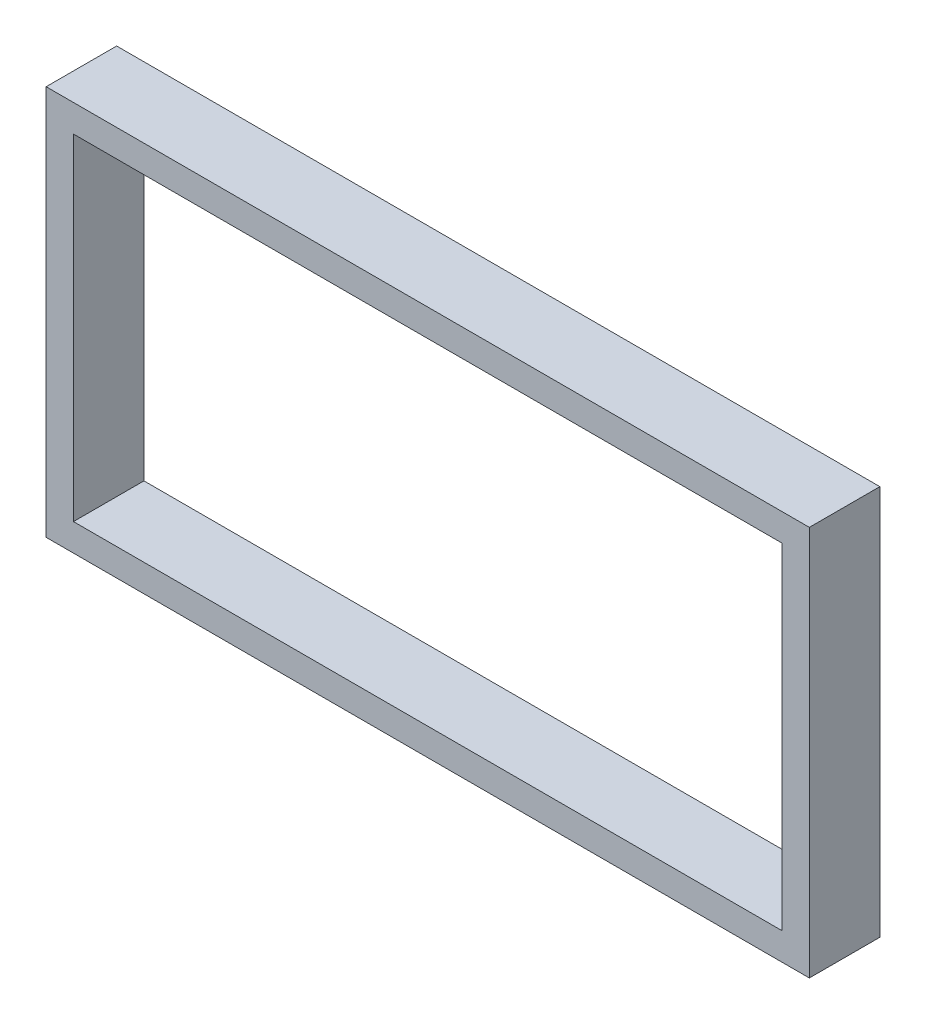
ISO-10303-21;
HEADER;
FILE_DESCRIPTION(('STEP AP214'),'2;1');
FILE_NAME('part.step','',(''),(''),'','','');
FILE_SCHEMA(('AUTOMOTIVE_DESIGN { 1 0 10303 214 1 1 1 1 }'));
ENDSEC;
DATA;
#1=APPLICATION_CONTEXT('core data for automotive mechanical design processes');
#2=APPLICATION_PROTOCOL_DEFINITION('international standard','automotive_design',2000,#1);
#3=PRODUCT_CONTEXT('',#1,'mechanical');
#4=PRODUCT('Part','Part','',(#3));
#5=PRODUCT_RELATED_PRODUCT_CATEGORY('part','',(#4));
#6=PRODUCT_DEFINITION_FORMATION('','',#4);
#7=PRODUCT_DEFINITION_CONTEXT('part definition',#1,'design');
#8=PRODUCT_DEFINITION('design','',#6,#7);
#9=PRODUCT_DEFINITION_SHAPE('','',#8);
#10=(LENGTH_UNIT() NAMED_UNIT(*) SI_UNIT(.MILLI.,.METRE.));
#11=(NAMED_UNIT(*) PLANE_ANGLE_UNIT() SI_UNIT($,.RADIAN.));
#12=(NAMED_UNIT(*) SI_UNIT($,.STERADIAN.) SOLID_ANGLE_UNIT());
#13=UNCERTAINTY_MEASURE_WITH_UNIT(LENGTH_MEASURE(1.E-05),#10,'distance_accuracy_value','');
#14=(GEOMETRIC_REPRESENTATION_CONTEXT(3) GLOBAL_UNCERTAINTY_ASSIGNED_CONTEXT((#13)) GLOBAL_UNIT_ASSIGNED_CONTEXT((#10,
#11,#12)) REPRESENTATION_CONTEXT('',''));
#15=CARTESIAN_POINT('',(0.,0.,0.));
#16=DIRECTION('',(0.,0.,1.));
#17=DIRECTION('',(1.,0.,0.));
#18=AXIS2_PLACEMENT_3D('',#15,#16,#17);
#19=CARTESIAN_POINT('',(55.88,28.575,10.3251));
#20=DIRECTION('',(-1.,0.,0.));
#21=DIRECTION('',(0.,-1.,0.));
#22=AXIS2_PLACEMENT_3D('',#19,#20,#21);
#23=PLANE('',#22);
#24=DIRECTION('',(0.,1.,0.));
#25=VECTOR('',#24,1.);
#26=CARTESIAN_POINT('',(55.88,28.575,0.));
#27=LINE('',#26,#25);
#28=CARTESIAN_POINT('',(55.88,-28.575,0.));
#29=VERTEX_POINT('',#28);
#30=CARTESIAN_POINT('',(55.88,28.575,0.));
#31=VERTEX_POINT('',#30);
#32=EDGE_CURVE('E130',#29,#31,#27,.T.);
#33=ORIENTED_EDGE('',*,*,#32,.T.);
#34=DIRECTION('',(0.,0.,-1.));
#35=VECTOR('',#34,1.);
#36=CARTESIAN_POINT('',(55.88,28.575,10.3251));
#37=LINE('',#36,#35);
#38=CARTESIAN_POINT('',(55.88,28.575,10.3251));
#39=VERTEX_POINT('',#38);
#40=EDGE_CURVE('E11',#39,#31,#37,.T.);
#41=ORIENTED_EDGE('',*,*,#40,.F.);
#42=DIRECTION('',(0.,1.,0.));
#43=VECTOR('',#42,1.);
#44=CARTESIAN_POINT('',(55.88,28.575,10.3251));
#45=LINE('',#44,#43);
#46=CARTESIAN_POINT('',(55.88,-28.575,10.3251));
#47=VERTEX_POINT('',#46);
#48=EDGE_CURVE('E134',#47,#39,#45,.T.);
#49=ORIENTED_EDGE('',*,*,#48,.F.);
#50=DIRECTION('',(0.,0.,-1.));
#51=VECTOR('',#50,1.);
#52=CARTESIAN_POINT('',(55.88,-28.575,10.3251));
#53=LINE('',#52,#51);
#54=EDGE_CURVE('E144',#47,#29,#53,.T.);
#55=ORIENTED_EDGE('',*,*,#54,.T.);
#56=EDGE_LOOP('',(#33,#41,#49,#55));
#57=FACE_BOUND('',#56,.T.);
#58=ADVANCED_FACE('F33',(#57),#23,.F.);
#59=CARTESIAN_POINT('',(-55.88,28.575,10.3251));
#60=DIRECTION('',(0.,-1.,0.));
#61=DIRECTION('',(0.,0.,-1.));
#62=AXIS2_PLACEMENT_3D('',#59,#60,#61);
#63=PLANE('',#62);
#64=DIRECTION('',(-1.,0.,0.));
#65=VECTOR('',#64,1.);
#66=CARTESIAN_POINT('',(-55.88,28.575,0.));
#67=LINE('',#66,#65);
#68=CARTESIAN_POINT('',(-55.88,28.575,0.));
#69=VERTEX_POINT('',#68);
#70=EDGE_CURVE('E147',#31,#69,#67,.T.);
#71=ORIENTED_EDGE('',*,*,#70,.T.);
#72=DIRECTION('',(0.,0.,-1.));
#73=VECTOR('',#72,1.);
#74=CARTESIAN_POINT('',(-55.88,28.575,10.3251));
#75=LINE('',#74,#73);
#76=CARTESIAN_POINT('',(-55.88,28.575,10.3251));
#77=VERTEX_POINT('',#76);
#78=EDGE_CURVE('E40',#77,#69,#75,.T.);
#79=ORIENTED_EDGE('',*,*,#78,.F.);
#80=DIRECTION('',(-1.,0.,0.));
#81=VECTOR('',#80,1.);
#82=CARTESIAN_POINT('',(-55.88,28.575,10.3251));
#83=LINE('',#82,#81);
#84=EDGE_CURVE('E137',#39,#77,#83,.T.);
#85=ORIENTED_EDGE('',*,*,#84,.F.);
#86=ORIENTED_EDGE('',*,*,#40,.T.);
#87=EDGE_LOOP('',(#71,#79,#85,#86));
#88=FACE_BOUND('',#87,.T.);
#89=ADVANCED_FACE('F175',(#88),#63,.F.);
#90=CARTESIAN_POINT('',(-55.88,28.575,10.3251));
#91=DIRECTION('',(1.,0.,0.));
#92=DIRECTION('',(0.,0.,-1.));
#93=AXIS2_PLACEMENT_3D('',#90,#91,#92);
#94=PLANE('',#93);
#95=DIRECTION('',(0.,-1.,0.));
#96=VECTOR('',#95,1.);
#97=CARTESIAN_POINT('',(-55.88,28.575,0.));
#98=LINE('',#97,#96);
#99=CARTESIAN_POINT('',(-55.88,-28.575,0.));
#100=VERTEX_POINT('',#99);
#101=EDGE_CURVE('E149',#69,#100,#98,.T.);
#102=ORIENTED_EDGE('',*,*,#101,.T.);
#103=DIRECTION('',(0.,0.,-1.));
#104=VECTOR('',#103,1.);
#105=CARTESIAN_POINT('',(-55.88,-28.575,10.3251));
#106=LINE('',#105,#104);
#107=CARTESIAN_POINT('',(-55.88,-28.575,10.3251));
#108=VERTEX_POINT('',#107);
#109=EDGE_CURVE('E154',#108,#100,#106,.T.);
#110=ORIENTED_EDGE('',*,*,#109,.F.);
#111=DIRECTION('',(0.,-1.,0.));
#112=VECTOR('',#111,1.);
#113=CARTESIAN_POINT('',(-55.88,28.575,10.3251));
#114=LINE('',#113,#112);
#115=EDGE_CURVE('E140',#77,#108,#114,.T.);
#116=ORIENTED_EDGE('',*,*,#115,.F.);
#117=ORIENTED_EDGE('',*,*,#78,.T.);
#118=EDGE_LOOP('',(#102,#110,#116,#117));
#119=FACE_BOUND('',#118,.T.);
#120=ADVANCED_FACE('F161',(#119),#94,.F.);
#121=CARTESIAN_POINT('',(-55.88,-28.575,10.3251));
#122=DIRECTION('',(0.,1.,0.));
#123=DIRECTION('',(0.,0.,1.));
#124=AXIS2_PLACEMENT_3D('',#121,#122,#123);
#125=PLANE('',#124);
#126=DIRECTION('',(1.,0.,0.));
#127=VECTOR('',#126,1.);
#128=CARTESIAN_POINT('',(-55.88,-28.575,0.));
#129=LINE('',#128,#127);
#130=EDGE_CURVE('E138',#100,#29,#129,.T.);
#131=ORIENTED_EDGE('',*,*,#130,.T.);
#132=ORIENTED_EDGE('',*,*,#54,.F.);
#133=DIRECTION('',(1.,0.,0.));
#134=VECTOR('',#133,1.);
#135=CARTESIAN_POINT('',(-55.88,-28.575,10.3251));
#136=LINE('',#135,#134);
#137=EDGE_CURVE('E142',#108,#47,#136,.T.);
#138=ORIENTED_EDGE('',*,*,#137,.F.);
#139=ORIENTED_EDGE('',*,*,#109,.T.);
#140=EDGE_LOOP('',(#131,#132,#138,#139));
#141=FACE_BOUND('',#140,.T.);
#142=ADVANCED_FACE('F168',(#141),#125,.F.);
#143=CARTESIAN_POINT('',(0.,0.,10.3251));
#144=DIRECTION('',(0.,0.,1.));
#145=DIRECTION('',(1.,0.,0.));
#146=AXIS2_PLACEMENT_3D('',#143,#144,#145);
#147=PLANE('',#146);
#148=DIRECTION('',(0.,1.,0.));
#149=VECTOR('',#148,1.);
#150=CARTESIAN_POINT('',(51.88,24.575,10.3251));
#151=LINE('',#150,#149);
#152=CARTESIAN_POINT('',(51.88,-24.575,10.3251));
#153=VERTEX_POINT('',#152);
#154=CARTESIAN_POINT('',(51.88,24.575,10.3251));
#155=VERTEX_POINT('',#154);
#156=EDGE_CURVE('E47',#153,#155,#151,.T.);
#157=ORIENTED_EDGE('',*,*,#156,.F.);
#158=DIRECTION('',(1.,0.,0.));
#159=VECTOR('',#158,1.);
#160=CARTESIAN_POINT('',(-51.88,-24.575,10.3251));
#161=LINE('',#160,#159);
#162=CARTESIAN_POINT('',(-51.88,-24.575,10.3251));
#163=VERTEX_POINT('',#162);
#164=EDGE_CURVE('E115',#163,#153,#161,.T.);
#165=ORIENTED_EDGE('',*,*,#164,.F.);
#166=DIRECTION('',(0.,-1.,0.));
#167=VECTOR('',#166,1.);
#168=CARTESIAN_POINT('',(-51.88,24.575,10.3251));
#169=LINE('',#168,#167);
#170=CARTESIAN_POINT('',(-51.88,24.575,10.3251));
#171=VERTEX_POINT('',#170);
#172=EDGE_CURVE('E118',#171,#163,#169,.T.);
#173=ORIENTED_EDGE('',*,*,#172,.F.);
#174=DIRECTION('',(-1.,0.,0.));
#175=VECTOR('',#174,1.);
#176=CARTESIAN_POINT('',(-51.88,24.575,10.3251));
#177=LINE('',#176,#175);
#178=EDGE_CURVE('E124',#155,#171,#177,.T.);
#179=ORIENTED_EDGE('',*,*,#178,.F.);
#180=EDGE_LOOP('',(#157,#165,#173,#179));
#181=FACE_BOUND('',#180,.T.);
#182=ORIENTED_EDGE('',*,*,#48,.T.);
#183=ORIENTED_EDGE('',*,*,#84,.T.);
#184=ORIENTED_EDGE('',*,*,#115,.T.);
#185=ORIENTED_EDGE('',*,*,#137,.T.);
#186=EDGE_LOOP('',(#182,#183,#184,#185));
#187=FACE_BOUND('',#186,.T.);
#188=ADVANCED_FACE('F174',(#181,#187),#147,.T.);
#189=CARTESIAN_POINT('',(0.,0.,0.));
#190=DIRECTION('',(0.,0.,1.));
#191=DIRECTION('',(1.,0.,0.));
#192=AXIS2_PLACEMENT_3D('',#189,#190,#191);
#193=PLANE('',#192);
#194=DIRECTION('',(1.,0.,0.));
#195=VECTOR('',#194,1.);
#196=CARTESIAN_POINT('',(-51.88,-24.575,0.));
#197=LINE('',#196,#195);
#198=CARTESIAN_POINT('',(-51.88,-24.575,0.));
#199=VERTEX_POINT('',#198);
#200=CARTESIAN_POINT('',(51.88,-24.575,0.));
#201=VERTEX_POINT('',#200);
#202=EDGE_CURVE('E105',#199,#201,#197,.T.);
#203=ORIENTED_EDGE('',*,*,#202,.T.);
#204=DIRECTION('',(0.,1.,0.));
#205=VECTOR('',#204,1.);
#206=CARTESIAN_POINT('',(51.88,24.575,0.));
#207=LINE('',#206,#205);
#208=CARTESIAN_POINT('',(51.88,24.575,0.));
#209=VERTEX_POINT('',#208);
#210=EDGE_CURVE('E99',#201,#209,#207,.T.);
#211=ORIENTED_EDGE('',*,*,#210,.T.);
#212=DIRECTION('',(-1.,0.,0.));
#213=VECTOR('',#212,1.);
#214=CARTESIAN_POINT('',(-51.88,24.575,0.));
#215=LINE('',#214,#213);
#216=CARTESIAN_POINT('',(-51.88,24.575,0.));
#217=VERTEX_POINT('',#216);
#218=EDGE_CURVE('E108',#209,#217,#215,.T.);
#219=ORIENTED_EDGE('',*,*,#218,.T.);
#220=DIRECTION('',(0.,-1.,0.));
#221=VECTOR('',#220,1.);
#222=CARTESIAN_POINT('',(-51.88,24.575,0.));
#223=LINE('',#222,#221);
#224=EDGE_CURVE('E55',#217,#199,#223,.T.);
#225=ORIENTED_EDGE('',*,*,#224,.T.);
#226=EDGE_LOOP('',(#203,#211,#219,#225));
#227=FACE_BOUND('',#226,.T.);
#228=ORIENTED_EDGE('',*,*,#32,.F.);
#229=ORIENTED_EDGE('',*,*,#130,.F.);
#230=ORIENTED_EDGE('',*,*,#101,.F.);
#231=ORIENTED_EDGE('',*,*,#70,.F.);
#232=EDGE_LOOP('',(#228,#229,#230,#231));
#233=FACE_BOUND('',#232,.T.);
#234=ADVANCED_FACE('F112',(#227,#233),#193,.F.);
#235=CARTESIAN_POINT('',(51.88,24.575,0.));
#236=DIRECTION('',(1.,0.,0.));
#237=DIRECTION('',(0.,0.,-1.));
#238=AXIS2_PLACEMENT_3D('',#235,#236,#237);
#239=PLANE('',#238);
#240=ORIENTED_EDGE('',*,*,#156,.T.);
#241=DIRECTION('',(0.,0.,1.));
#242=VECTOR('',#241,1.);
#243=CARTESIAN_POINT('',(51.88,24.575,0.));
#244=LINE('',#243,#242);
#245=EDGE_CURVE('E95',#209,#155,#244,.T.);
#246=ORIENTED_EDGE('',*,*,#245,.F.);
#247=ORIENTED_EDGE('',*,*,#210,.F.);
#248=DIRECTION('',(0.,0.,1.));
#249=VECTOR('',#248,1.);
#250=CARTESIAN_POINT('',(51.88,-24.575,0.));
#251=LINE('',#250,#249);
#252=EDGE_CURVE('E128',#201,#153,#251,.T.);
#253=ORIENTED_EDGE('',*,*,#252,.T.);
#254=EDGE_LOOP('',(#240,#246,#247,#253));
#255=FACE_BOUND('',#254,.T.);
#256=ADVANCED_FACE('F97',(#255),#239,.F.);
#257=CARTESIAN_POINT('',(-51.88,-24.575,0.));
#258=DIRECTION('',(0.,-1.,0.));
#259=DIRECTION('',(0.,0.,-1.));
#260=AXIS2_PLACEMENT_3D('',#257,#258,#259);
#261=PLANE('',#260);
#262=ORIENTED_EDGE('',*,*,#164,.T.);
#263=ORIENTED_EDGE('',*,*,#252,.F.);
#264=ORIENTED_EDGE('',*,*,#202,.F.);
#265=DIRECTION('',(0.,0.,1.));
#266=VECTOR('',#265,1.);
#267=CARTESIAN_POINT('',(-51.88,-24.575,0.));
#268=LINE('',#267,#266);
#269=EDGE_CURVE('E131',#199,#163,#268,.T.);
#270=ORIENTED_EDGE('',*,*,#269,.T.);
#271=EDGE_LOOP('',(#262,#263,#264,#270));
#272=FACE_BOUND('',#271,.T.);
#273=ADVANCED_FACE('F192',(#272),#261,.F.);
#274=CARTESIAN_POINT('',(-51.88,24.575,0.));
#275=DIRECTION('',(-1.,0.,0.));
#276=DIRECTION('',(0.,0.,1.));
#277=AXIS2_PLACEMENT_3D('',#274,#275,#276);
#278=PLANE('',#277);
#279=ORIENTED_EDGE('',*,*,#172,.T.);
#280=ORIENTED_EDGE('',*,*,#269,.F.);
#281=ORIENTED_EDGE('',*,*,#224,.F.);
#282=DIRECTION('',(0.,0.,1.));
#283=VECTOR('',#282,1.);
#284=CARTESIAN_POINT('',(-51.88,24.575,0.));
#285=LINE('',#284,#283);
#286=EDGE_CURVE('E104',#217,#171,#285,.T.);
#287=ORIENTED_EDGE('',*,*,#286,.T.);
#288=EDGE_LOOP('',(#279,#280,#281,#287));
#289=FACE_BOUND('',#288,.T.);
#290=ADVANCED_FACE('F195',(#289),#278,.F.);
#291=CARTESIAN_POINT('',(-51.88,24.575,0.));
#292=DIRECTION('',(0.,1.,0.));
#293=DIRECTION('',(0.,0.,1.));
#294=AXIS2_PLACEMENT_3D('',#291,#292,#293);
#295=PLANE('',#294);
#296=ORIENTED_EDGE('',*,*,#178,.T.);
#297=ORIENTED_EDGE('',*,*,#286,.F.);
#298=ORIENTED_EDGE('',*,*,#218,.F.);
#299=ORIENTED_EDGE('',*,*,#245,.T.);
#300=EDGE_LOOP('',(#296,#297,#298,#299));
#301=FACE_BOUND('',#300,.T.);
#302=ADVANCED_FACE('F109',(#301),#295,.F.);
#303=CLOSED_SHELL('',(#58,#89,#120,#142,#188,#234,#256,#273,#290,#302));
#304=MANIFOLD_SOLID_BREP('B2',#303);
#305=ADVANCED_BREP_SHAPE_REPRESENTATION('',(#18,#304),#14);
#306=SHAPE_DEFINITION_REPRESENTATION(#9,#305);
ENDSEC;
END-ISO-10303-21;
